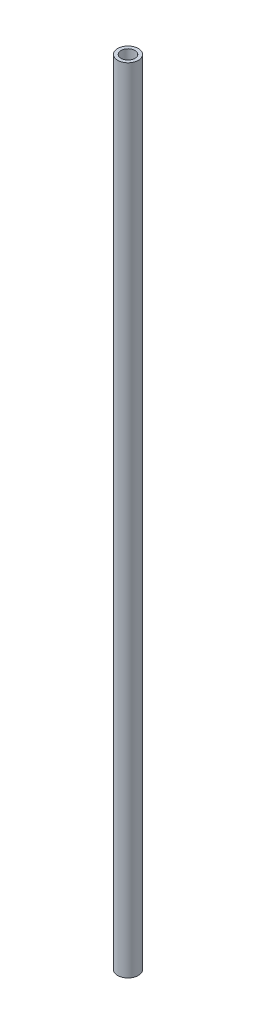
ISO-10303-21;
HEADER;
FILE_DESCRIPTION(('STEP AP214'),'2;1');
FILE_NAME('part.step','',(''),(''),'','','');
FILE_SCHEMA(('AUTOMOTIVE_DESIGN { 1 0 10303 214 1 1 1 1 }'));
ENDSEC;
DATA;
#1=APPLICATION_CONTEXT('core data for automotive mechanical design processes');
#2=APPLICATION_PROTOCOL_DEFINITION('international standard','automotive_design',2000,#1);
#3=PRODUCT_CONTEXT('',#1,'mechanical');
#4=PRODUCT('Part','Part','',(#3));
#5=PRODUCT_RELATED_PRODUCT_CATEGORY('part','',(#4));
#6=PRODUCT_DEFINITION_FORMATION('','',#4);
#7=PRODUCT_DEFINITION_CONTEXT('part definition',#1,'design');
#8=PRODUCT_DEFINITION('design','',#6,#7);
#9=PRODUCT_DEFINITION_SHAPE('','',#8);
#10=(LENGTH_UNIT() NAMED_UNIT(*) SI_UNIT(.MILLI.,.METRE.));
#11=(NAMED_UNIT(*) PLANE_ANGLE_UNIT() SI_UNIT($,.RADIAN.));
#12=(NAMED_UNIT(*) SI_UNIT($,.STERADIAN.) SOLID_ANGLE_UNIT());
#13=UNCERTAINTY_MEASURE_WITH_UNIT(LENGTH_MEASURE(1.E-05),#10,'distance_accuracy_value','');
#14=(GEOMETRIC_REPRESENTATION_CONTEXT(3) GLOBAL_UNCERTAINTY_ASSIGNED_CONTEXT((#13)) GLOBAL_UNIT_ASSIGNED_CONTEXT((#10,
#11,#12)) REPRESENTATION_CONTEXT('',''));
#15=CARTESIAN_POINT('',(0.,0.,0.));
#16=DIRECTION('',(0.,0.,1.));
#17=DIRECTION('',(1.,0.,0.));
#18=AXIS2_PLACEMENT_3D('',#15,#16,#17);
#19=CARTESIAN_POINT('',(0.,304.8,0.));
#20=DIRECTION('',(0.,1.,0.));
#21=DIRECTION('',(0.,0.,1.));
#22=AXIS2_PLACEMENT_3D('',#19,#20,#21);
#23=PLANE('',#22);
#24=CARTESIAN_POINT('',(0.,304.8,0.));
#25=DIRECTION('',(0.,1.,0.));
#26=DIRECTION('',(0.,0.,1.));
#27=AXIS2_PLACEMENT_3D('',#24,#25,#26);
#28=CIRCLE('',#27,3.9624);
#29=CARTESIAN_POINT('',(0.,304.8,-3.9624));
#30=VERTEX_POINT('',#29);
#31=EDGE_CURVE('E10',#30,#30,#28,.T.);
#32=ORIENTED_EDGE('',*,*,#31,.T.);
#33=EDGE_LOOP('',(#32));
#34=FACE_BOUND('',#33,.T.);
#35=CARTESIAN_POINT('',(0.,304.8,0.));
#36=DIRECTION('',(0.,1.,0.));
#37=DIRECTION('',(0.,0.,1.));
#38=AXIS2_PLACEMENT_3D('',#35,#36,#37);
#39=CIRCLE('',#38,2.667);
#40=CARTESIAN_POINT('',(0.,304.8,-2.667));
#41=VERTEX_POINT('',#40);
#42=EDGE_CURVE('E41',#41,#41,#39,.T.);
#43=ORIENTED_EDGE('',*,*,#42,.F.);
#44=EDGE_LOOP('',(#43));
#45=FACE_BOUND('',#44,.T.);
#46=ADVANCED_FACE('F30',(#34,#45),#23,.T.);
#47=CARTESIAN_POINT('',(0.,0.,0.));
#48=DIRECTION('',(0.,1.,0.));
#49=DIRECTION('',(0.,0.,1.));
#50=AXIS2_PLACEMENT_3D('',#47,#48,#49);
#51=PLANE('',#50);
#52=CARTESIAN_POINT('',(0.,0.,0.));
#53=DIRECTION('',(0.,1.,0.));
#54=DIRECTION('',(0.,0.,1.));
#55=AXIS2_PLACEMENT_3D('',#52,#53,#54);
#56=CIRCLE('',#55,3.9624);
#57=CARTESIAN_POINT('',(0.,0.,-3.9624));
#58=VERTEX_POINT('',#57);
#59=EDGE_CURVE('E34',#58,#58,#56,.T.);
#60=ORIENTED_EDGE('',*,*,#59,.F.);
#61=EDGE_LOOP('',(#60));
#62=FACE_BOUND('',#61,.T.);
#63=CARTESIAN_POINT('',(0.,0.,0.));
#64=DIRECTION('',(0.,1.,0.));
#65=DIRECTION('',(0.,0.,1.));
#66=AXIS2_PLACEMENT_3D('',#63,#64,#65);
#67=CIRCLE('',#66,2.667);
#68=CARTESIAN_POINT('',(0.,0.,-2.667));
#69=VERTEX_POINT('',#68);
#70=EDGE_CURVE('E43',#69,#69,#67,.T.);
#71=ORIENTED_EDGE('',*,*,#70,.T.);
#72=EDGE_LOOP('',(#71));
#73=FACE_BOUND('',#72,.T.);
#74=ADVANCED_FACE('F53',(#62,#73),#51,.F.);
#75=CARTESIAN_POINT('',(0.,304.8,0.));
#76=DIRECTION('',(0.,-1.,0.));
#77=DIRECTION('',(0.,0.,-1.));
#78=AXIS2_PLACEMENT_3D('',#75,#76,#77);
#79=CYLINDRICAL_SURFACE('',#78,3.9624);
#80=CARTESIAN_POINT('',(0.,304.8,-3.9624));
#81=CARTESIAN_POINT('',(0.,301.625,-3.9624));
#82=CARTESIAN_POINT('',(0.,298.45,-3.9624));
#83=CARTESIAN_POINT('',(0.,292.1,-3.9624));
#84=CARTESIAN_POINT('',(0.,288.925,-3.9624));
#85=CARTESIAN_POINT('',(0.,282.575,-3.9624));
#86=CARTESIAN_POINT('',(0.,279.4,-3.9624));
#87=CARTESIAN_POINT('',(0.,273.05,-3.9624));
#88=CARTESIAN_POINT('',(0.,269.875,-3.9624));
#89=CARTESIAN_POINT('',(0.,263.525,-3.9624));
#90=CARTESIAN_POINT('',(0.,260.35,-3.9624));
#91=CARTESIAN_POINT('',(0.,254.,-3.9624));
#92=CARTESIAN_POINT('',(0.,250.825,-3.9624));
#93=CARTESIAN_POINT('',(0.,244.475,-3.9624));
#94=CARTESIAN_POINT('',(0.,241.3,-3.9624));
#95=CARTESIAN_POINT('',(0.,234.95,-3.9624));
#96=CARTESIAN_POINT('',(0.,231.775,-3.9624));
#97=CARTESIAN_POINT('',(0.,225.425,-3.9624));
#98=CARTESIAN_POINT('',(0.,222.25,-3.9624));
#99=CARTESIAN_POINT('',(0.,215.9,-3.9624));
#100=CARTESIAN_POINT('',(0.,212.725,-3.9624));
#101=CARTESIAN_POINT('',(0.,206.375,-3.9624));
#102=CARTESIAN_POINT('',(0.,203.2,-3.9624));
#103=CARTESIAN_POINT('',(0.,196.85,-3.9624));
#104=CARTESIAN_POINT('',(0.,193.675,-3.9624));
#105=CARTESIAN_POINT('',(0.,187.325,-3.9624));
#106=CARTESIAN_POINT('',(0.,184.15,-3.9624));
#107=CARTESIAN_POINT('',(0.,177.8,-3.9624));
#108=CARTESIAN_POINT('',(0.,174.625,-3.9624));
#109=CARTESIAN_POINT('',(0.,168.275,-3.9624));
#110=CARTESIAN_POINT('',(0.,165.1,-3.9624));
#111=CARTESIAN_POINT('',(0.,158.75,-3.9624));
#112=CARTESIAN_POINT('',(0.,155.575,-3.9624));
#113=CARTESIAN_POINT('',(0.,149.225,-3.9624));
#114=CARTESIAN_POINT('',(0.,146.05,-3.9624));
#115=CARTESIAN_POINT('',(0.,139.7,-3.9624));
#116=CARTESIAN_POINT('',(0.,136.525,-3.9624));
#117=CARTESIAN_POINT('',(0.,130.175,-3.9624));
#118=CARTESIAN_POINT('',(0.,127.,-3.9624));
#119=CARTESIAN_POINT('',(0.,120.65,-3.9624));
#120=CARTESIAN_POINT('',(0.,117.475,-3.9624));
#121=CARTESIAN_POINT('',(0.,111.125,-3.9624));
#122=CARTESIAN_POINT('',(0.,107.95,-3.9624));
#123=CARTESIAN_POINT('',(0.,101.6,-3.9624));
#124=CARTESIAN_POINT('',(0.,98.425,-3.9624));
#125=CARTESIAN_POINT('',(0.,92.075,-3.9624));
#126=CARTESIAN_POINT('',(0.,88.9,-3.9624));
#127=CARTESIAN_POINT('',(0.,82.55,-3.9624));
#128=CARTESIAN_POINT('',(0.,79.375,-3.9624));
#129=CARTESIAN_POINT('',(0.,73.025,-3.9624));
#130=CARTESIAN_POINT('',(0.,69.85,-3.9624));
#131=CARTESIAN_POINT('',(0.,63.5,-3.9624));
#132=CARTESIAN_POINT('',(0.,60.325,-3.9624));
#133=CARTESIAN_POINT('',(0.,53.975,-3.9624));
#134=CARTESIAN_POINT('',(0.,50.8,-3.9624));
#135=CARTESIAN_POINT('',(0.,44.45,-3.9624));
#136=CARTESIAN_POINT('',(0.,41.275,-3.9624));
#137=CARTESIAN_POINT('',(0.,34.925,-3.9624));
#138=CARTESIAN_POINT('',(0.,31.75,-3.9624));
#139=CARTESIAN_POINT('',(0.,25.4,-3.9624));
#140=CARTESIAN_POINT('',(0.,22.225,-3.9624));
#141=CARTESIAN_POINT('',(0.,15.875,-3.9624));
#142=CARTESIAN_POINT('',(0.,12.7,-3.9624));
#143=CARTESIAN_POINT('',(0.,6.35,-3.9624));
#144=CARTESIAN_POINT('',(0.,3.175,-3.9624));
#145=CARTESIAN_POINT('',(0.,0.,-3.9624));
#146=B_SPLINE_CURVE_WITH_KNOTS('',3,(#80,#81,#82,#83,#84,#85,#86,#87,#88,#89,#90,#91,#92,#93,
#94,#95,#96,#97,#98,#99,#100,#101,#102,#103,#104,#105,#106,#107,#108,#109,#110,#111,#112,#113,
#114,#115,#116,#117,#118,#119,#120,#121,#122,#123,#124,#125,#126,#127,#128,#129,#130,#131,#132,
#133,#134,#135,#136,#137,#138,#139,#140,#141,#142,#143,#144,#145),.UNSPECIFIED.,.F.,.F.,(4,2,2,
2,2,2,2,2,2,2,2,2,2,2,2,2,2,2,2,2,2,2,2,2,2,2,2,2,2,2,2,2,4),(0.,9.52499999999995,19.05,28.575,
38.1,47.625,57.15,66.675,76.2,85.725,95.2499999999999,104.775,114.3,123.825,133.35,142.875,
152.4,161.925,171.45,180.975,190.5,200.025,209.55,219.075,228.6,238.125,247.65,257.175,266.7,
276.225,285.75,295.275,304.8),.UNSPECIFIED.);
#147=EDGE_CURVE('BSEAM32',#30,#58,#146,.T.);
#148=ORIENTED_EDGE('',*,*,#31,.F.);
#149=ORIENTED_EDGE('',*,*,#59,.T.);
#150=ORIENTED_EDGE('',*,*,#147,.T.);
#151=ORIENTED_EDGE('',*,*,#147,.F.);
#152=EDGE_LOOP('',(#148,#150,#149,#151));
#153=FACE_BOUND('',#152,.T.);
#154=ADVANCED_FACE('F32',(#153),#79,.T.);
#155=CARTESIAN_POINT('',(0.,304.8,0.));
#156=DIRECTION('',(0.,-1.,0.));
#157=DIRECTION('',(0.,0.,-1.));
#158=AXIS2_PLACEMENT_3D('',#155,#156,#157);
#159=CYLINDRICAL_SURFACE('',#158,2.667);
#160=CARTESIAN_POINT('',(0.,304.8,-2.667));
#161=CARTESIAN_POINT('',(0.,301.625,-2.667));
#162=CARTESIAN_POINT('',(0.,298.45,-2.667));
#163=CARTESIAN_POINT('',(0.,292.1,-2.667));
#164=CARTESIAN_POINT('',(0.,288.925,-2.667));
#165=CARTESIAN_POINT('',(0.,282.575,-2.667));
#166=CARTESIAN_POINT('',(0.,279.4,-2.667));
#167=CARTESIAN_POINT('',(0.,273.05,-2.667));
#168=CARTESIAN_POINT('',(0.,269.875,-2.667));
#169=CARTESIAN_POINT('',(0.,263.525,-2.667));
#170=CARTESIAN_POINT('',(0.,260.35,-2.667));
#171=CARTESIAN_POINT('',(0.,254.,-2.667));
#172=CARTESIAN_POINT('',(0.,250.825,-2.667));
#173=CARTESIAN_POINT('',(0.,244.475,-2.667));
#174=CARTESIAN_POINT('',(0.,241.3,-2.667));
#175=CARTESIAN_POINT('',(0.,234.95,-2.667));
#176=CARTESIAN_POINT('',(0.,231.775,-2.667));
#177=CARTESIAN_POINT('',(0.,225.425,-2.667));
#178=CARTESIAN_POINT('',(0.,222.25,-2.667));
#179=CARTESIAN_POINT('',(0.,215.9,-2.667));
#180=CARTESIAN_POINT('',(0.,212.725,-2.667));
#181=CARTESIAN_POINT('',(0.,206.375,-2.667));
#182=CARTESIAN_POINT('',(0.,203.2,-2.667));
#183=CARTESIAN_POINT('',(0.,196.85,-2.667));
#184=CARTESIAN_POINT('',(0.,193.675,-2.667));
#185=CARTESIAN_POINT('',(0.,187.325,-2.667));
#186=CARTESIAN_POINT('',(0.,184.15,-2.667));
#187=CARTESIAN_POINT('',(0.,177.8,-2.667));
#188=CARTESIAN_POINT('',(0.,174.625,-2.667));
#189=CARTESIAN_POINT('',(0.,168.275,-2.667));
#190=CARTESIAN_POINT('',(0.,165.1,-2.667));
#191=CARTESIAN_POINT('',(0.,158.75,-2.667));
#192=CARTESIAN_POINT('',(0.,155.575,-2.667));
#193=CARTESIAN_POINT('',(0.,149.225,-2.667));
#194=CARTESIAN_POINT('',(0.,146.05,-2.667));
#195=CARTESIAN_POINT('',(0.,139.7,-2.667));
#196=CARTESIAN_POINT('',(0.,136.525,-2.667));
#197=CARTESIAN_POINT('',(0.,130.175,-2.667));
#198=CARTESIAN_POINT('',(0.,127.,-2.667));
#199=CARTESIAN_POINT('',(0.,120.65,-2.667));
#200=CARTESIAN_POINT('',(0.,117.475,-2.667));
#201=CARTESIAN_POINT('',(0.,111.125,-2.667));
#202=CARTESIAN_POINT('',(0.,107.95,-2.667));
#203=CARTESIAN_POINT('',(0.,101.6,-2.667));
#204=CARTESIAN_POINT('',(0.,98.425,-2.667));
#205=CARTESIAN_POINT('',(0.,92.075,-2.667));
#206=CARTESIAN_POINT('',(0.,88.9,-2.667));
#207=CARTESIAN_POINT('',(0.,82.55,-2.667));
#208=CARTESIAN_POINT('',(0.,79.375,-2.667));
#209=CARTESIAN_POINT('',(0.,73.025,-2.667));
#210=CARTESIAN_POINT('',(0.,69.85,-2.667));
#211=CARTESIAN_POINT('',(0.,63.5,-2.667));
#212=CARTESIAN_POINT('',(0.,60.325,-2.667));
#213=CARTESIAN_POINT('',(0.,53.975,-2.667));
#214=CARTESIAN_POINT('',(0.,50.8,-2.667));
#215=CARTESIAN_POINT('',(0.,44.45,-2.667));
#216=CARTESIAN_POINT('',(0.,41.275,-2.667));
#217=CARTESIAN_POINT('',(0.,34.925,-2.667));
#218=CARTESIAN_POINT('',(0.,31.75,-2.667));
#219=CARTESIAN_POINT('',(0.,25.4,-2.667));
#220=CARTESIAN_POINT('',(0.,22.225,-2.667));
#221=CARTESIAN_POINT('',(0.,15.875,-2.667));
#222=CARTESIAN_POINT('',(0.,12.7,-2.667));
#223=CARTESIAN_POINT('',(0.,6.35,-2.667));
#224=CARTESIAN_POINT('',(0.,3.175,-2.667));
#225=CARTESIAN_POINT('',(0.,0.,-2.667));
#226=B_SPLINE_CURVE_WITH_KNOTS('',3,(#160,#161,#162,#163,#164,#165,#166,#167,#168,#169,#170,
#171,#172,#173,#174,#175,#176,#177,#178,#179,#180,#181,#182,#183,#184,#185,#186,#187,#188,#189,
#190,#191,#192,#193,#194,#195,#196,#197,#198,#199,#200,#201,#202,#203,#204,#205,#206,#207,#208,
#209,#210,#211,#212,#213,#214,#215,#216,#217,#218,#219,#220,#221,#222,#223,#224,#225),
.UNSPECIFIED.,.F.,.F.,(4,2,2,2,2,2,2,2,2,2,2,2,2,2,2,2,2,2,2,2,2,2,2,2,2,2,2,2,2,2,2,2,4),(0.,
9.52499999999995,19.05,28.575,38.1,47.625,57.15,66.675,76.2,85.725,95.2499999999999,104.775,
114.3,123.825,133.35,142.875,152.4,161.925,171.45,180.975,190.5,200.025,209.55,219.075,228.6,
238.125,247.65,257.175,266.7,276.225,285.75,295.275,304.8),.UNSPECIFIED.);
#227=EDGE_CURVE('BSEAM49',#41,#69,#226,.T.);
#228=ORIENTED_EDGE('',*,*,#42,.T.);
#229=ORIENTED_EDGE('',*,*,#70,.F.);
#230=ORIENTED_EDGE('',*,*,#227,.T.);
#231=ORIENTED_EDGE('',*,*,#227,.F.);
#232=EDGE_LOOP('',(#228,#230,#229,#231));
#233=FACE_BOUND('',#232,.T.);
#234=ADVANCED_FACE('F49',(#233),#159,.F.);
#235=CLOSED_SHELL('',(#46,#74,#154,#234));
#236=MANIFOLD_SOLID_BREP('B2',#235);
#237=ADVANCED_BREP_SHAPE_REPRESENTATION('',(#18,#236),#14);
#238=SHAPE_DEFINITION_REPRESENTATION(#9,#237);
ENDSEC;
END-ISO-10303-21;
